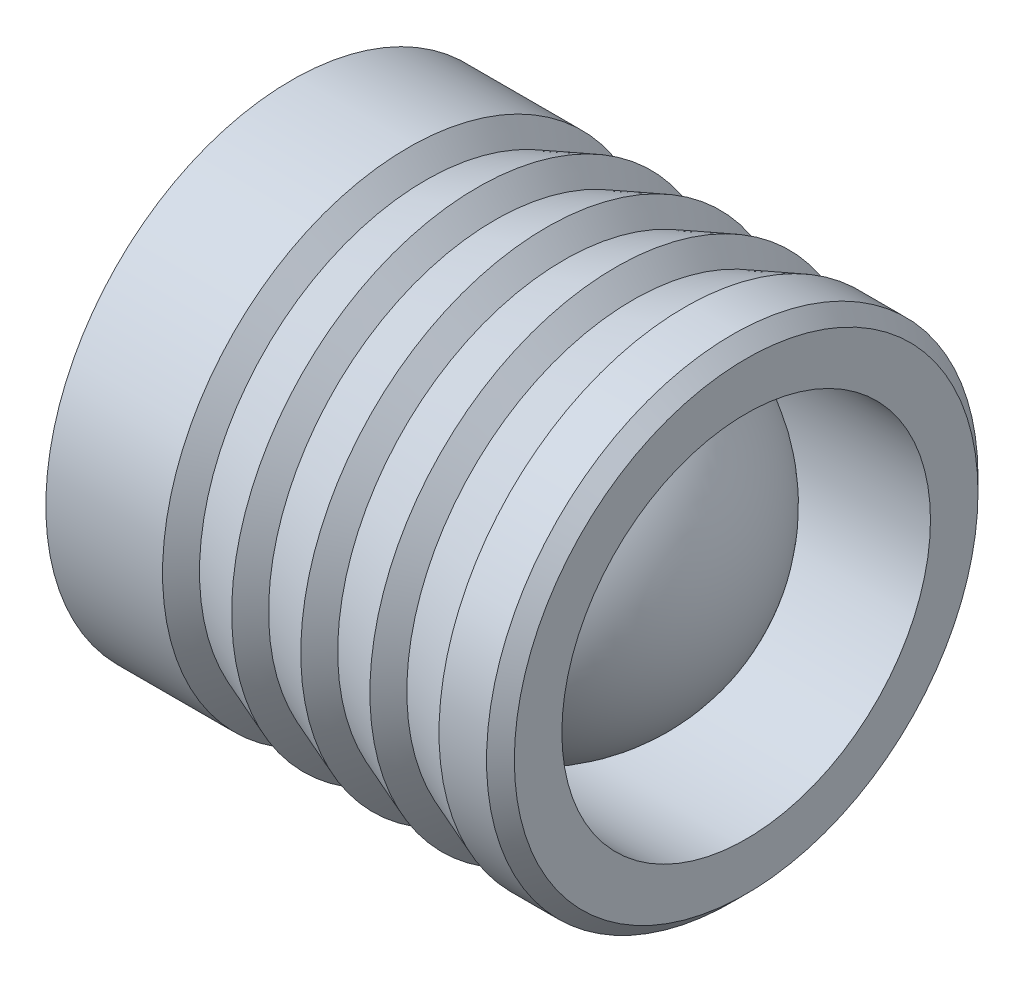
ISO-10303-21;
HEADER;
FILE_DESCRIPTION(('STEP AP214'),'2;1');
FILE_NAME('part.step','',(''),(''),'','','');
FILE_SCHEMA(('AUTOMOTIVE_DESIGN { 1 0 10303 214 1 1 1 1 }'));
ENDSEC;
DATA;
#1=APPLICATION_CONTEXT('core data for automotive mechanical design processes');
#2=APPLICATION_PROTOCOL_DEFINITION('international standard','automotive_design',2000,#1);
#3=PRODUCT_CONTEXT('',#1,'mechanical');
#4=PRODUCT('Part','Part','',(#3));
#5=PRODUCT_RELATED_PRODUCT_CATEGORY('part','',(#4));
#6=PRODUCT_DEFINITION_FORMATION('','',#4);
#7=PRODUCT_DEFINITION_CONTEXT('part definition',#1,'design');
#8=PRODUCT_DEFINITION('design','',#6,#7);
#9=PRODUCT_DEFINITION_SHAPE('','',#8);
#10=(LENGTH_UNIT() NAMED_UNIT(*) SI_UNIT(.MILLI.,.METRE.));
#11=(NAMED_UNIT(*) PLANE_ANGLE_UNIT() SI_UNIT($,.RADIAN.));
#12=(NAMED_UNIT(*) SI_UNIT($,.STERADIAN.) SOLID_ANGLE_UNIT());
#13=UNCERTAINTY_MEASURE_WITH_UNIT(LENGTH_MEASURE(1.E-05),#10,'distance_accuracy_value','');
#14=(GEOMETRIC_REPRESENTATION_CONTEXT(3) GLOBAL_UNCERTAINTY_ASSIGNED_CONTEXT((#13)) GLOBAL_UNIT_ASSIGNED_CONTEXT((#10,
#11,#12)) REPRESENTATION_CONTEXT('',''));
#15=CARTESIAN_POINT('',(0.,0.,0.));
#16=DIRECTION('',(0.,0.,1.));
#17=DIRECTION('',(1.,0.,0.));
#18=AXIS2_PLACEMENT_3D('',#15,#16,#17);
#19=CARTESIAN_POINT('',(2.29,0.,0.));
#20=DIRECTION('',(1.,0.,0.));
#21=DIRECTION('',(0.,-1.,0.));
#22=AXIS2_PLACEMENT_3D('',#19,#20,#21);
#23=SPHERICAL_SURFACE('',#22,1.51);
#24=CARTESIAN_POINT('',(2.46349438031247,0.,0.));
#25=DIRECTION('',(-1.,0.,0.));
#26=DIRECTION('',(0.,0.,1.));
#27=AXIS2_PLACEMENT_3D('',#24,#25,#26);
#28=CIRCLE('',#27,1.4999999);
#29=CARTESIAN_POINT('',(2.46349438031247,0.,1.4999999));
#30=VERTEX_POINT('',#29);
#31=EDGE_CURVE('E41',#30,#30,#28,.T.);
#32=ORIENTED_EDGE('',*,*,#31,.F.);
#33=EDGE_LOOP('',(#32));
#34=FACE_BOUND('',#33,.T.);
#35=CARTESIAN_POINT('',(3.8,0.,0.));
#36=VERTEX_POINT('',#35);
#37=VERTEX_LOOP('',#36);
#38=FACE_BOUND('',#37,.T.);
#39=ADVANCED_FACE('F18',(#34,#38),#23,.T.);
#40=CARTESIAN_POINT('',(4.,1.88686291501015,0.));
#41=DIRECTION('',(-1.,0.,0.));
#42=DIRECTION('',(0.,0.,1.));
#43=AXIS2_PLACEMENT_3D('',#40,#41,#42);
#44=PLANE('',#43);
#45=CARTESIAN_POINT('',(4.,0.,0.));
#46=DIRECTION('',(1.,0.,0.));
#47=DIRECTION('',(0.,0.,-1.));
#48=AXIS2_PLACEMENT_3D('',#45,#46,#47);
#49=CIRCLE('',#48,1.886862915);
#50=CARTESIAN_POINT('',(4.,0.,-1.88686291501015));
#51=VERTEX_POINT('',#50);
#52=EDGE_CURVE('E11',#51,#51,#49,.T.);
#53=ORIENTED_EDGE('',*,*,#52,.T.);
#54=EDGE_LOOP('',(#53));
#55=FACE_BOUND('',#54,.T.);
#56=CARTESIAN_POINT('',(4.,0.,0.));
#57=DIRECTION('',(1.,0.,0.));
#58=DIRECTION('',(0.,0.,-1.));
#59=AXIS2_PLACEMENT_3D('',#56,#57,#58);
#60=CIRCLE('',#59,1.4999999);
#61=CARTESIAN_POINT('',(4.,0.,-1.49999989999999));
#62=VERTEX_POINT('',#61);
#63=EDGE_CURVE('E29',#62,#62,#60,.T.);
#64=ORIENTED_EDGE('',*,*,#63,.F.);
#65=EDGE_LOOP('',(#64));
#66=FACE_BOUND('',#65,.T.);
#67=ADVANCED_FACE('F227',(#55,#66),#44,.F.);
#68=CARTESIAN_POINT('',(4.,0.,0.));
#69=DIRECTION('',(-1.,0.,0.));
#70=DIRECTION('',(0.,0.,-1.));
#71=AXIS2_PLACEMENT_3D('',#68,#69,#70);
#72=CYLINDRICAL_SURFACE('',#71,1.4999999);
#73=ORIENTED_EDGE('',*,*,#63,.T.);
#74=EDGE_LOOP('',(#73));
#75=FACE_BOUND('',#74,.T.);
#76=ORIENTED_EDGE('',*,*,#31,.T.);
#77=EDGE_LOOP('',(#76));
#78=FACE_BOUND('',#77,.T.);
#79=ADVANCED_FACE('F211',(#75,#78),#72,.F.);
#80=CARTESIAN_POINT('',(0.,0.,0.));
#81=DIRECTION('',(1.,0.,0.));
#82=DIRECTION('',(0.,1.,0.));
#83=AXIS2_PLACEMENT_3D('',#80,#81,#82);
#84=PLANE('',#83);
#85=CARTESIAN_POINT('',(0.,0.,0.));
#86=DIRECTION('',(1.,0.,0.));
#87=DIRECTION('',(0.,0.,-1.));
#88=AXIS2_PLACEMENT_3D('',#85,#86,#87);
#89=CIRCLE('',#88,1.4803847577);
#90=CARTESIAN_POINT('',(0.,0.,-1.48038475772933));
#91=VERTEX_POINT('',#90);
#92=EDGE_CURVE('E102',#91,#91,#89,.T.);
#93=ORIENTED_EDGE('',*,*,#92,.F.);
#94=EDGE_LOOP('',(#93));
#95=FACE_BOUND('',#94,.T.);
#96=ADVANCED_FACE('F207',(#95),#84,.F.);
#97=CARTESIAN_POINT('',(3.88686291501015,0.,0.));
#98=DIRECTION('',(-1.,0.,0.));
#99=DIRECTION('',(0.,0.,1.));
#100=AXIS2_PLACEMENT_3D('',#97,#98,#99);
#101=CONICAL_SURFACE('',#100,2.,0.7853981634);
#102=CARTESIAN_POINT('',(3.88686291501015,0.,0.));
#103=DIRECTION('',(1.,0.,0.));
#104=DIRECTION('',(0.,0.,-1.));
#105=AXIS2_PLACEMENT_3D('',#102,#103,#104);
#106=CIRCLE('',#105,2.);
#107=CARTESIAN_POINT('',(3.88686291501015,0.,-2.));
#108=VERTEX_POINT('',#107);
#109=EDGE_CURVE('E109',#108,#108,#106,.T.);
#110=ORIENTED_EDGE('',*,*,#109,.T.);
#111=EDGE_LOOP('',(#110));
#112=FACE_BOUND('',#111,.T.);
#113=ORIENTED_EDGE('',*,*,#52,.F.);
#114=EDGE_LOOP('',(#113));
#115=FACE_BOUND('',#114,.T.);
#116=ADVANCED_FACE('F210',(#112,#115),#101,.T.);
#117=CARTESIAN_POINT('',(4.,0.,0.));
#118=DIRECTION('',(-1.,0.,0.));
#119=DIRECTION('',(0.,0.,-1.));
#120=AXIS2_PLACEMENT_3D('',#117,#118,#119);
#121=CYLINDRICAL_SURFACE('',#120,2.);
#122=CARTESIAN_POINT('',(3.5,0.,0.));
#123=DIRECTION('',(1.,0.,0.));
#124=DIRECTION('',(0.,0.,-1.));
#125=AXIS2_PLACEMENT_3D('',#122,#123,#124);
#126=CIRCLE('',#125,2.);
#127=CARTESIAN_POINT('',(3.5,0.,-2.));
#128=VERTEX_POINT('',#127);
#129=EDGE_CURVE('E138',#128,#128,#126,.T.);
#130=ORIENTED_EDGE('',*,*,#129,.T.);
#131=EDGE_LOOP('',(#130));
#132=FACE_BOUND('',#131,.T.);
#133=ORIENTED_EDGE('',*,*,#109,.F.);
#134=EDGE_LOOP('',(#133));
#135=FACE_BOUND('',#134,.T.);
#136=ADVANCED_FACE('F214',(#132,#135),#121,.T.);
#137=CARTESIAN_POINT('',(3.078125,0.,0.));
#138=DIRECTION('',(1.,0.,0.));
#139=DIRECTION('',(0.,0.,-1.));
#140=AXIS2_PLACEMENT_3D('',#137,#138,#139);
#141=CONICAL_SURFACE('',#140,1.84,0.3624995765);
#142=ORIENTED_EDGE('',*,*,#129,.F.);
#143=EDGE_LOOP('',(#142));
#144=FACE_BOUND('',#143,.T.);
#145=CARTESIAN_POINT('',(3.078125,0.,0.));
#146=DIRECTION('',(1.,0.,0.));
#147=DIRECTION('',(0.,0.,-1.));
#148=AXIS2_PLACEMENT_3D('',#145,#146,#147);
#149=CIRCLE('',#148,1.84);
#150=CARTESIAN_POINT('',(3.078125,0.,-1.84));
#151=VERTEX_POINT('',#150);
#152=EDGE_CURVE('E135',#151,#151,#149,.T.);
#153=ORIENTED_EDGE('',*,*,#152,.T.);
#154=EDGE_LOOP('',(#153));
#155=FACE_BOUND('',#154,.T.);
#156=ADVANCED_FACE('F218',(#144,#155),#141,.T.);
#157=CARTESIAN_POINT('',(2.9375,0.,0.));
#158=DIRECTION('',(-1.,0.,0.));
#159=DIRECTION('',(0.,0.,1.));
#160=AXIS2_PLACEMENT_3D('',#157,#158,#159);
#161=CONICAL_SURFACE('',#160,2.,0.8497582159);
#162=CARTESIAN_POINT('',(2.9375,0.,0.));
#163=DIRECTION('',(1.,0.,0.));
#164=DIRECTION('',(0.,0.,-1.));
#165=AXIS2_PLACEMENT_3D('',#162,#163,#164);
#166=CIRCLE('',#165,2.);
#167=CARTESIAN_POINT('',(2.9375,0.,-2.));
#168=VERTEX_POINT('',#167);
#169=EDGE_CURVE('E139',#168,#168,#166,.T.);
#170=ORIENTED_EDGE('',*,*,#169,.T.);
#171=EDGE_LOOP('',(#170));
#172=FACE_BOUND('',#171,.T.);
#173=ORIENTED_EDGE('',*,*,#152,.F.);
#174=EDGE_LOOP('',(#173));
#175=FACE_BOUND('',#174,.T.);
#176=ADVANCED_FACE('F223',(#172,#175),#161,.T.);
#177=CARTESIAN_POINT('',(2.515625,0.,0.));
#178=DIRECTION('',(1.,0.,0.));
#179=DIRECTION('',(0.,0.,-1.));
#180=AXIS2_PLACEMENT_3D('',#177,#178,#179);
#181=CONICAL_SURFACE('',#180,1.84,0.3624995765);
#182=ORIENTED_EDGE('',*,*,#169,.F.);
#183=EDGE_LOOP('',(#182));
#184=FACE_BOUND('',#183,.T.);
#185=CARTESIAN_POINT('',(2.515625,0.,0.));
#186=DIRECTION('',(1.,0.,0.));
#187=DIRECTION('',(0.,0.,-1.));
#188=AXIS2_PLACEMENT_3D('',#185,#186,#187);
#189=CIRCLE('',#188,1.84);
#190=CARTESIAN_POINT('',(2.515625,0.,-1.84));
#191=VERTEX_POINT('',#190);
#192=EDGE_CURVE('E149',#191,#191,#189,.T.);
#193=ORIENTED_EDGE('',*,*,#192,.T.);
#194=EDGE_LOOP('',(#193));
#195=FACE_BOUND('',#194,.T.);
#196=ADVANCED_FACE('F220',(#184,#195),#181,.T.);
#197=CARTESIAN_POINT('',(2.375,0.,0.));
#198=DIRECTION('',(-1.,0.,0.));
#199=DIRECTION('',(0.,0.,1.));
#200=AXIS2_PLACEMENT_3D('',#197,#198,#199);
#201=CONICAL_SURFACE('',#200,2.,0.8497582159);
#202=CARTESIAN_POINT('',(2.375,0.,0.));
#203=DIRECTION('',(1.,0.,0.));
#204=DIRECTION('',(0.,0.,-1.));
#205=AXIS2_PLACEMENT_3D('',#202,#203,#204);
#206=CIRCLE('',#205,2.);
#207=CARTESIAN_POINT('',(2.375,0.,-2.));
#208=VERTEX_POINT('',#207);
#209=EDGE_CURVE('E145',#208,#208,#206,.T.);
#210=ORIENTED_EDGE('',*,*,#209,.T.);
#211=EDGE_LOOP('',(#210));
#212=FACE_BOUND('',#211,.T.);
#213=ORIENTED_EDGE('',*,*,#192,.F.);
#214=EDGE_LOOP('',(#213));
#215=FACE_BOUND('',#214,.T.);
#216=ADVANCED_FACE('F205',(#212,#215),#201,.T.);
#217=CARTESIAN_POINT('',(1.953125,0.,0.));
#218=DIRECTION('',(1.,0.,0.));
#219=DIRECTION('',(0.,0.,-1.));
#220=AXIS2_PLACEMENT_3D('',#217,#218,#219);
#221=CONICAL_SURFACE('',#220,1.84,0.3624995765);
#222=ORIENTED_EDGE('',*,*,#209,.F.);
#223=EDGE_LOOP('',(#222));
#224=FACE_BOUND('',#223,.T.);
#225=CARTESIAN_POINT('',(1.953125,0.,0.));
#226=DIRECTION('',(1.,0.,0.));
#227=DIRECTION('',(0.,0.,-1.));
#228=AXIS2_PLACEMENT_3D('',#225,#226,#227);
#229=CIRCLE('',#228,1.84);
#230=CARTESIAN_POINT('',(1.953125,0.,-1.84));
#231=VERTEX_POINT('',#230);
#232=EDGE_CURVE('E130',#231,#231,#229,.T.);
#233=ORIENTED_EDGE('',*,*,#232,.T.);
#234=EDGE_LOOP('',(#233));
#235=FACE_BOUND('',#234,.T.);
#236=ADVANCED_FACE('F201',(#224,#235),#221,.T.);
#237=CARTESIAN_POINT('',(1.8125,0.,0.));
#238=DIRECTION('',(-1.,0.,0.));
#239=DIRECTION('',(0.,0.,1.));
#240=AXIS2_PLACEMENT_3D('',#237,#238,#239);
#241=CONICAL_SURFACE('',#240,2.,0.8497582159);
#242=CARTESIAN_POINT('',(1.8125,0.,0.));
#243=DIRECTION('',(1.,0.,0.));
#244=DIRECTION('',(0.,0.,-1.));
#245=AXIS2_PLACEMENT_3D('',#242,#243,#244);
#246=CIRCLE('',#245,2.);
#247=CARTESIAN_POINT('',(1.8125,0.,-2.));
#248=VERTEX_POINT('',#247);
#249=EDGE_CURVE('E124',#248,#248,#246,.T.);
#250=ORIENTED_EDGE('',*,*,#249,.T.);
#251=EDGE_LOOP('',(#250));
#252=FACE_BOUND('',#251,.T.);
#253=ORIENTED_EDGE('',*,*,#232,.F.);
#254=EDGE_LOOP('',(#253));
#255=FACE_BOUND('',#254,.T.);
#256=ADVANCED_FACE('F204',(#252,#255),#241,.T.);
#257=CARTESIAN_POINT('',(1.390625,0.,0.));
#258=DIRECTION('',(1.,0.,0.));
#259=DIRECTION('',(0.,0.,-1.));
#260=AXIS2_PLACEMENT_3D('',#257,#258,#259);
#261=CONICAL_SURFACE('',#260,1.84,0.3624995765);
#262=ORIENTED_EDGE('',*,*,#249,.F.);
#263=EDGE_LOOP('',(#262));
#264=FACE_BOUND('',#263,.T.);
#265=CARTESIAN_POINT('',(1.390625,0.,0.));
#266=DIRECTION('',(1.,0.,0.));
#267=DIRECTION('',(0.,0.,-1.));
#268=AXIS2_PLACEMENT_3D('',#265,#266,#267);
#269=CIRCLE('',#268,1.84);
#270=CARTESIAN_POINT('',(1.390625,0.,-1.84));
#271=VERTEX_POINT('',#270);
#272=EDGE_CURVE('E121',#271,#271,#269,.T.);
#273=ORIENTED_EDGE('',*,*,#272,.T.);
#274=EDGE_LOOP('',(#273));
#275=FACE_BOUND('',#274,.T.);
#276=ADVANCED_FACE('F232',(#264,#275),#261,.T.);
#277=CARTESIAN_POINT('',(1.25,0.,0.));
#278=DIRECTION('',(-1.,0.,0.));
#279=DIRECTION('',(0.,0.,1.));
#280=AXIS2_PLACEMENT_3D('',#277,#278,#279);
#281=CONICAL_SURFACE('',#280,2.,0.8497582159);
#282=CARTESIAN_POINT('',(1.25,0.,0.));
#283=DIRECTION('',(1.,0.,0.));
#284=DIRECTION('',(0.,0.,-1.));
#285=AXIS2_PLACEMENT_3D('',#282,#283,#284);
#286=CIRCLE('',#285,2.);
#287=CARTESIAN_POINT('',(1.25,0.,-2.));
#288=VERTEX_POINT('',#287);
#289=EDGE_CURVE('E22',#288,#288,#286,.T.);
#290=ORIENTED_EDGE('',*,*,#289,.T.);
#291=EDGE_LOOP('',(#290));
#292=FACE_BOUND('',#291,.T.);
#293=ORIENTED_EDGE('',*,*,#272,.F.);
#294=EDGE_LOOP('',(#293));
#295=FACE_BOUND('',#294,.T.);
#296=ADVANCED_FACE('F20',(#292,#295),#281,.T.);
#297=CARTESIAN_POINT('',(4.,0.,0.));
#298=DIRECTION('',(-1.,0.,0.));
#299=DIRECTION('',(0.,0.,-1.));
#300=AXIS2_PLACEMENT_3D('',#297,#298,#299);
#301=CYLINDRICAL_SURFACE('',#300,2.);
#302=CARTESIAN_POINT('',(0.3,0.,0.));
#303=DIRECTION('',(1.,0.,0.));
#304=DIRECTION('',(0.,0.,-1.));
#305=AXIS2_PLACEMENT_3D('',#302,#303,#304);
#306=CIRCLE('',#305,2.);
#307=CARTESIAN_POINT('',(0.3,0.,-2.));
#308=VERTEX_POINT('',#307);
#309=EDGE_CURVE('E133',#308,#308,#306,.T.);
#310=ORIENTED_EDGE('',*,*,#309,.T.);
#311=EDGE_LOOP('',(#310));
#312=FACE_BOUND('',#311,.T.);
#313=ORIENTED_EDGE('',*,*,#289,.F.);
#314=EDGE_LOOP('',(#313));
#315=FACE_BOUND('',#314,.T.);
#316=ADVANCED_FACE('F236',(#312,#315),#301,.T.);
#317=CARTESIAN_POINT('',(0.,0.,0.));
#318=DIRECTION('',(1.,0.,0.));
#319=DIRECTION('',(0.,0.,-1.));
#320=AXIS2_PLACEMENT_3D('',#317,#318,#319);
#321=CONICAL_SURFACE('',#320,1.4803847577,1.0471975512);
#322=ORIENTED_EDGE('',*,*,#309,.F.);
#323=EDGE_LOOP('',(#322));
#324=FACE_BOUND('',#323,.T.);
#325=ORIENTED_EDGE('',*,*,#92,.T.);
#326=EDGE_LOOP('',(#325));
#327=FACE_BOUND('',#326,.T.);
#328=ADVANCED_FACE('F199',(#324,#327),#321,.T.);
#329=CLOSED_SHELL('',(#39,#67,#79,#96,#116,#136,#156,#176,#196,#216,#236,#256,#276,#296,#316,#328));
#330=CARTESIAN_POINT('',(1.06602534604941,0.,0.));
#331=DIRECTION('',(1.,0.,0.));
#332=DIRECTION('',(0.,0.,-1.));
#333=AXIS2_PLACEMENT_3D('',#330,#331,#332);
#334=CONICAL_SURFACE('',#333,1.4999999,1.0471975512);
#335=CARTESIAN_POINT('',(1.06602534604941,0.,0.));
#336=DIRECTION('',(1.,0.,0.));
#337=DIRECTION('',(0.,0.,-1.));
#338=AXIS2_PLACEMENT_3D('',#335,#336,#337);
#339=CIRCLE('',#338,1.4999999);
#340=CARTESIAN_POINT('',(1.06602534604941,0.,-1.4999999));
#341=VERTEX_POINT('',#340);
#342=EDGE_CURVE('E156',#341,#341,#339,.T.);
#343=ORIENTED_EDGE('',*,*,#342,.T.);
#344=EDGE_LOOP('',(#343));
#345=FACE_BOUND('',#344,.T.);
#346=CARTESIAN_POINT('',(0.2,0.,0.));
#347=VERTEX_POINT('',#346);
#348=VERTEX_LOOP('',#347);
#349=FACE_BOUND('',#348,.T.);
#350=ADVANCED_FACE('F185',(#345,#349),#334,.F.);
#351=CARTESIAN_POINT('',(2.29,0.,0.));
#352=DIRECTION('',(1.,0.,0.));
#353=DIRECTION('',(0.,-1.,0.));
#354=AXIS2_PLACEMENT_3D('',#351,#352,#353);
#355=SPHERICAL_SURFACE('',#354,1.51);
#356=CARTESIAN_POINT('',(2.11650561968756,0.,0.));
#357=DIRECTION('',(1.,0.,0.));
#358=DIRECTION('',(0.,0.,-1.));
#359=AXIS2_PLACEMENT_3D('',#356,#357,#358);
#360=CIRCLE('',#359,1.4999999);
#361=CARTESIAN_POINT('',(2.11650561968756,0.,-1.4999999));
#362=VERTEX_POINT('',#361);
#363=EDGE_CURVE('E160',#362,#362,#360,.T.);
#364=ORIENTED_EDGE('',*,*,#363,.F.);
#365=EDGE_LOOP('',(#364));
#366=FACE_BOUND('',#365,.T.);
#367=CARTESIAN_POINT('',(0.780000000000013,0.,0.));
#368=VERTEX_POINT('',#367);
#369=VERTEX_LOOP('',#368);
#370=FACE_BOUND('',#369,.T.);
#371=ADVANCED_FACE('F182',(#366,#370),#355,.T.);
#372=CARTESIAN_POINT('',(4.,0.,0.));
#373=DIRECTION('',(-1.,0.,0.));
#374=DIRECTION('',(0.,0.,-1.));
#375=AXIS2_PLACEMENT_3D('',#372,#373,#374);
#376=CYLINDRICAL_SURFACE('',#375,1.4999999);
#377=ORIENTED_EDGE('',*,*,#363,.T.);
#378=EDGE_LOOP('',(#377));
#379=FACE_BOUND('',#378,.T.);
#380=ORIENTED_EDGE('',*,*,#342,.F.);
#381=EDGE_LOOP('',(#380));
#382=FACE_BOUND('',#381,.T.);
#383=ADVANCED_FACE('F179',(#379,#382),#376,.F.);
#384=CLOSED_SHELL('',(#350,#371,#383));
#385=ORIENTED_CLOSED_SHELL('',*,#384,.T.);
#386=BREP_WITH_VOIDS('B1',#329,(#385));
#387=ADVANCED_BREP_SHAPE_REPRESENTATION('',(#18,#386),#14);
#388=SHAPE_DEFINITION_REPRESENTATION(#9,#387);
ENDSEC;
END-ISO-10303-21;
